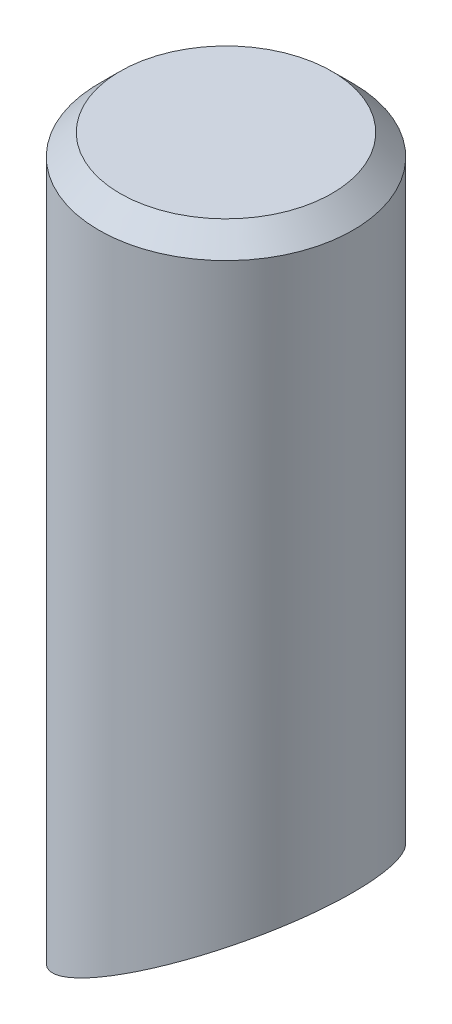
ISO-10303-21;
HEADER;
FILE_DESCRIPTION(('STEP AP214'),'2;1');
FILE_NAME('part.step','',(''),(''),'','','');
FILE_SCHEMA(('AUTOMOTIVE_DESIGN { 1 0 10303 214 1 1 1 1 }'));
ENDSEC;
DATA;
#1=APPLICATION_CONTEXT('core data for automotive mechanical design processes');
#2=APPLICATION_PROTOCOL_DEFINITION('international standard','automotive_design',2000,#1);
#3=PRODUCT_CONTEXT('',#1,'mechanical');
#4=PRODUCT('Part','Part','',(#3));
#5=PRODUCT_RELATED_PRODUCT_CATEGORY('part','',(#4));
#6=PRODUCT_DEFINITION_FORMATION('','',#4);
#7=PRODUCT_DEFINITION_CONTEXT('part definition',#1,'design');
#8=PRODUCT_DEFINITION('design','',#6,#7);
#9=PRODUCT_DEFINITION_SHAPE('','',#8);
#10=(LENGTH_UNIT() NAMED_UNIT(*) SI_UNIT(.MILLI.,.METRE.));
#11=(NAMED_UNIT(*) PLANE_ANGLE_UNIT() SI_UNIT($,.RADIAN.));
#12=(NAMED_UNIT(*) SI_UNIT($,.STERADIAN.) SOLID_ANGLE_UNIT());
#13=UNCERTAINTY_MEASURE_WITH_UNIT(LENGTH_MEASURE(1.E-05),#10,'distance_accuracy_value','');
#14=(GEOMETRIC_REPRESENTATION_CONTEXT(3) GLOBAL_UNCERTAINTY_ASSIGNED_CONTEXT((#13)) GLOBAL_UNIT_ASSIGNED_CONTEXT((#10,
#11,#12)) REPRESENTATION_CONTEXT('',''));
#15=CARTESIAN_POINT('',(0.,0.,0.));
#16=DIRECTION('',(0.,0.,1.));
#17=DIRECTION('',(1.,0.,0.));
#18=AXIS2_PLACEMENT_3D('',#15,#16,#17);
#19=CARTESIAN_POINT('',(12.,84.8590909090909,0.));
#20=DIRECTION('',(0.,1.,0.));
#21=DIRECTION('',(0.,0.,1.));
#22=AXIS2_PLACEMENT_3D('',#19,#20,#21);
#23=CYLINDRICAL_SURFACE('',#22,12.);
#24=CARTESIAN_POINT('',(12.,67.9999999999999,0.));
#25=DIRECTION('',(0.,1.,0.));
#26=DIRECTION('',(0.,0.,1.));
#27=AXIS2_PLACEMENT_3D('',#24,#25,#26);
#28=CIRCLE('',#27,12.);
#29=CARTESIAN_POINT('',(12.,67.9999999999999,12.));
#30=VERTEX_POINT('',#29);
#31=EDGE_CURVE('E10',#30,#30,#28,.F.);
#32=ORIENTED_EDGE('',*,*,#31,.T.);
#33=EDGE_LOOP('',(#32));
#34=FACE_BOUND('',#33,.T.);
#35=CARTESIAN_POINT('',(12.,6.92820323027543,0.));
#36=DIRECTION('',(-0.499999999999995,0.866025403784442,0.));
#37=DIRECTION('',(0.866025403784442,0.499999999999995,0.));
#38=AXIS2_PLACEMENT_3D('',#35,#36,#37);
#39=ELLIPSE('',#38,13.856406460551,12.);
#40=CARTESIAN_POINT('',(24.,13.8564064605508,0.));
#41=VERTEX_POINT('',#40);
#42=EDGE_CURVE('E38',#41,#41,#39,.F.);
#43=ORIENTED_EDGE('',*,*,#42,.F.);
#44=EDGE_LOOP('',(#43));
#45=FACE_BOUND('',#44,.T.);
#46=ADVANCED_FACE('F28',(#34,#45),#23,.T.);
#47=CARTESIAN_POINT('',(0.,70.0000000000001,0.));
#48=DIRECTION('',(0.,1.,0.));
#49=DIRECTION('',(0.,0.,1.));
#50=AXIS2_PLACEMENT_3D('',#47,#48,#49);
#51=PLANE('',#50);
#52=CARTESIAN_POINT('',(12.,70.0000000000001,0.));
#53=DIRECTION('',(0.,1.,0.));
#54=DIRECTION('',(0.,0.,1.));
#55=AXIS2_PLACEMENT_3D('',#52,#53,#54);
#56=CIRCLE('',#55,9.99999999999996);
#57=CARTESIAN_POINT('',(12.,70.0000000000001,9.99999999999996));
#58=VERTEX_POINT('',#57);
#59=EDGE_CURVE('E34',#58,#58,#56,.T.);
#60=ORIENTED_EDGE('',*,*,#59,.T.);
#61=EDGE_LOOP('',(#60));
#62=FACE_BOUND('',#61,.T.);
#63=ADVANCED_FACE('F48',(#62),#51,.T.);
#64=CARTESIAN_POINT('',(0.,0.,-100.));
#65=DIRECTION('',(-0.499999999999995,0.866025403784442,0.));
#66=DIRECTION('',(-0.866025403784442,-0.499999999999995,0.));
#67=AXIS2_PLACEMENT_3D('',#64,#65,#66);
#68=PLANE('',#67);
#69=ORIENTED_EDGE('',*,*,#42,.T.);
#70=EDGE_LOOP('',(#69));
#71=FACE_BOUND('',#70,.T.);
#72=ADVANCED_FACE('F45',(#71),#68,.F.);
#73=CARTESIAN_POINT('',(12.,70.0000000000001,0.));
#74=DIRECTION('',(0.,-1.,0.));
#75=DIRECTION('',(0.,0.,-1.));
#76=AXIS2_PLACEMENT_3D('',#73,#74,#75);
#77=CONICAL_SURFACE('',#76,9.99999999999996,0.785398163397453);
#78=ORIENTED_EDGE('',*,*,#31,.F.);
#79=EDGE_LOOP('',(#78));
#80=FACE_BOUND('',#79,.T.);
#81=ORIENTED_EDGE('',*,*,#59,.F.);
#82=EDGE_LOOP('',(#81));
#83=FACE_BOUND('',#82,.T.);
#84=ADVANCED_FACE('F55',(#80,#83),#77,.T.);
#85=CLOSED_SHELL('',(#46,#63,#72,#84));
#86=MANIFOLD_SOLID_BREP('B2',#85);
#87=ADVANCED_BREP_SHAPE_REPRESENTATION('',(#18,#86),#14);
#88=SHAPE_DEFINITION_REPRESENTATION(#9,#87);
ENDSEC;
END-ISO-10303-21;
